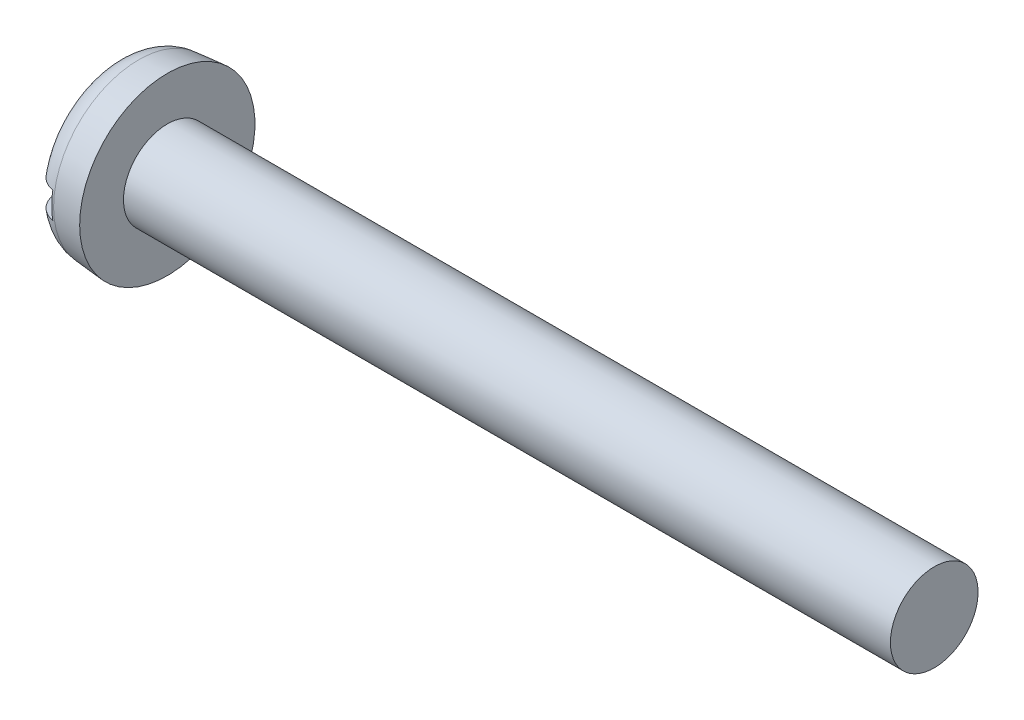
ISO-10303-21;
HEADER;
FILE_DESCRIPTION(('STEP AP214'),'2;1');
FILE_NAME('part.step','',(''),(''),'','','');
FILE_SCHEMA(('AUTOMOTIVE_DESIGN { 1 0 10303 214 1 1 1 1 }'));
ENDSEC;
DATA;
#1=APPLICATION_CONTEXT('core data for automotive mechanical design processes');
#2=APPLICATION_PROTOCOL_DEFINITION('international standard','automotive_design',2000,#1);
#3=PRODUCT_CONTEXT('',#1,'mechanical');
#4=PRODUCT('Part','Part','',(#3));
#5=PRODUCT_RELATED_PRODUCT_CATEGORY('part','',(#4));
#6=PRODUCT_DEFINITION_FORMATION('','',#4);
#7=PRODUCT_DEFINITION_CONTEXT('part definition',#1,'design');
#8=PRODUCT_DEFINITION('design','',#6,#7);
#9=PRODUCT_DEFINITION_SHAPE('','',#8);
#10=(LENGTH_UNIT() NAMED_UNIT(*) SI_UNIT(.MILLI.,.METRE.));
#11=(NAMED_UNIT(*) PLANE_ANGLE_UNIT() SI_UNIT($,.RADIAN.));
#12=(NAMED_UNIT(*) SI_UNIT($,.STERADIAN.) SOLID_ANGLE_UNIT());
#13=UNCERTAINTY_MEASURE_WITH_UNIT(LENGTH_MEASURE(1.E-05),#10,'distance_accuracy_value','');
#14=(GEOMETRIC_REPRESENTATION_CONTEXT(3) GLOBAL_UNCERTAINTY_ASSIGNED_CONTEXT((#13)) GLOBAL_UNIT_ASSIGNED_CONTEXT((#10,
#11,#12)) REPRESENTATION_CONTEXT('',''));
#15=CARTESIAN_POINT('',(0.,0.,0.));
#16=DIRECTION('',(0.,0.,1.));
#17=DIRECTION('',(1.,0.,0.));
#18=AXIS2_PLACEMENT_3D('',#15,#16,#17);
#19=CARTESIAN_POINT('',(0.,0.,0.));
#20=DIRECTION('',(-1.,0.,0.));
#21=DIRECTION('',(0.,0.,1.));
#22=AXIS2_PLACEMENT_3D('',#19,#20,#21);
#23=PLANE('',#22);
#24=DIRECTION('',(0.,0.,-1.));
#25=VECTOR('',#24,1.);
#26=CARTESIAN_POINT('',(0.,0.599999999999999,4.));
#27=LINE('',#26,#25);
#28=CARTESIAN_POINT('',(0.,0.599999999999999,2.62267277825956));
#29=VERTEX_POINT('',#28);
#30=CARTESIAN_POINT('',(0.,0.599999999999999,-2.62267277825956));
#31=VERTEX_POINT('',#30);
#32=EDGE_CURVE('E89',#29,#31,#27,.T.);
#33=ORIENTED_EDGE('',*,*,#32,.F.);
#34=CARTESIAN_POINT('',(0.,0.,0.));
#35=DIRECTION('',(-1.,0.,0.));
#36=DIRECTION('',(0.,0.,1.));
#37=AXIS2_PLACEMENT_3D('',#34,#35,#36);
#38=CIRCLE('',#37,2.69042979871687);
#39=EDGE_CURVE('E95',#29,#31,#38,.T.);
#40=ORIENTED_EDGE('',*,*,#39,.T.);
#41=EDGE_LOOP('',(#33,#40));
#42=FACE_BOUND('',#41,.T.);
#43=ADVANCED_FACE('F36',(#42),#23,.T.);
#44=CARTESIAN_POINT('',(-25.4,0.,0.));
#45=DIRECTION('',(-1.,0.,0.));
#46=DIRECTION('',(0.,0.,1.));
#47=AXIS2_PLACEMENT_3D('',#44,#45,#46);
#48=CYLINDRICAL_SURFACE('',#47,2.);
#49=CARTESIAN_POINT('',(37.4,0.,0.));
#50=DIRECTION('',(-1.,0.,0.));
#51=DIRECTION('',(0.,0.,1.));
#52=AXIS2_PLACEMENT_3D('',#49,#50,#51);
#53=CIRCLE('',#52,2.);
#54=CARTESIAN_POINT('',(37.4,0.,2.));
#55=VERTEX_POINT('',#54);
#56=EDGE_CURVE('E96',#55,#55,#53,.T.);
#57=ORIENTED_EDGE('',*,*,#56,.T.);
#58=EDGE_LOOP('',(#57));
#59=FACE_BOUND('',#58,.T.);
#60=CARTESIAN_POINT('',(2.4,0.,0.));
#61=DIRECTION('',(-1.,0.,0.));
#62=DIRECTION('',(0.,0.,1.));
#63=AXIS2_PLACEMENT_3D('',#60,#61,#62);
#64=CIRCLE('',#63,2.);
#65=CARTESIAN_POINT('',(2.4,0.,2.));
#66=VERTEX_POINT('',#65);
#67=EDGE_CURVE('E153',#66,#66,#64,.T.);
#68=ORIENTED_EDGE('',*,*,#67,.F.);
#69=EDGE_LOOP('',(#68));
#70=FACE_BOUND('',#69,.T.);
#71=ADVANCED_FACE('F141',(#59,#70),#48,.T.);
#72=CARTESIAN_POINT('',(37.4,2.,0.));
#73=DIRECTION('',(1.,0.,0.));
#74=DIRECTION('',(0.,0.,-1.));
#75=AXIS2_PLACEMENT_3D('',#72,#73,#74);
#76=PLANE('',#75);
#77=ORIENTED_EDGE('',*,*,#56,.F.);
#78=EDGE_LOOP('',(#77));
#79=FACE_BOUND('',#78,.T.);
#80=ADVANCED_FACE('F139',(#79),#76,.T.);
#81=DIRECTION('',(0.,0.,1.));
#82=VECTOR('',#81,1.);
#83=CARTESIAN_POINT('',(0.,-0.599999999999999,-4.));
#84=LINE('',#83,#82);
#85=CARTESIAN_POINT('',(0.,-0.6,-2.62267277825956));
#86=VERTEX_POINT('',#85);
#87=CARTESIAN_POINT('',(0.,-0.6,2.62267277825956));
#88=VERTEX_POINT('',#87);
#89=EDGE_CURVE('E80',#86,#88,#84,.T.);
#90=ORIENTED_EDGE('',*,*,#89,.F.);
#91=EDGE_CURVE('E87',#86,#88,#38,.T.);
#92=ORIENTED_EDGE('',*,*,#91,.T.);
#93=EDGE_LOOP('',(#90,#92));
#94=FACE_BOUND('',#93,.T.);
#95=ADVANCED_FACE('F86',(#94),#23,.T.);
#96=CARTESIAN_POINT('',(0.,0.,0.));
#97=DIRECTION('',(1.,0.,0.));
#98=DIRECTION('',(0.,0.,-1.));
#99=AXIS2_PLACEMENT_3D('',#96,#97,#98);
#100=CONICAL_SURFACE('',#99,3.79002720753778,0.0872664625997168);
#101=CARTESIAN_POINT('',(1.09541310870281,0.,0.));
#102=DIRECTION('',(-1.,0.,0.));
#103=DIRECTION('',(0.,0.,1.));
#104=AXIS2_PLACEMENT_3D('',#101,#102,#103);
#105=CIRCLE('',#104,3.88586343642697);
#106=CARTESIAN_POINT('',(1.09541310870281,0.,3.88586343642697));
#107=VERTEX_POINT('',#106);
#108=EDGE_CURVE('E99',#107,#107,#105,.F.);
#109=ORIENTED_EDGE('',*,*,#108,.T.);
#110=EDGE_LOOP('',(#109));
#111=FACE_BOUND('',#110,.T.);
#112=CARTESIAN_POINT('',(2.4,0.,0.));
#113=DIRECTION('',(-1.,0.,0.));
#114=DIRECTION('',(0.,0.,1.));
#115=AXIS2_PLACEMENT_3D('',#112,#113,#114);
#116=CIRCLE('',#115,4.);
#117=CARTESIAN_POINT('',(2.4,0.,4.));
#118=VERTEX_POINT('',#117);
#119=EDGE_CURVE('E101',#118,#118,#116,.T.);
#120=ORIENTED_EDGE('',*,*,#119,.T.);
#121=EDGE_LOOP('',(#120));
#122=FACE_BOUND('',#121,.T.);
#123=ADVANCED_FACE('F132',(#111,#122),#100,.T.);
#124=CARTESIAN_POINT('',(2.4,2.,0.));
#125=DIRECTION('',(-1.,0.,0.));
#126=DIRECTION('',(0.,0.,1.));
#127=AXIS2_PLACEMENT_3D('',#124,#125,#126);
#128=PLANE('',#127);
#129=ORIENTED_EDGE('',*,*,#119,.F.);
#130=EDGE_LOOP('',(#129));
#131=FACE_BOUND('',#130,.T.);
#132=ORIENTED_EDGE('',*,*,#67,.T.);
#133=EDGE_LOOP('',(#132));
#134=FACE_BOUND('',#133,.T.);
#135=ADVANCED_FACE('F128',(#131,#134),#128,.F.);
#136=CARTESIAN_POINT('',(1.2,0.,0.));
#137=DIRECTION('',(-1.,0.,0.));
#138=DIRECTION('',(0.,0.,1.));
#139=AXIS2_PLACEMENT_3D('',#136,#137,#138);
#140=TOROIDAL_SURFACE('',#139,2.69042979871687,1.2);
#141=CARTESIAN_POINT('',(0.3865043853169,0.599999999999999,-3.52185650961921));
#142=CARTESIAN_POINT('',(0.435468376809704,0.599999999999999,-3.56765543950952));
#143=CARTESIAN_POINT('',(0.48830443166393,0.599999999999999,-3.60938194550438));
#144=CARTESIAN_POINT('',(0.600265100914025,0.599999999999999,-3.68342203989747));
#145=CARTESIAN_POINT('',(0.659396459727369,0.599999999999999,-3.71572539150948));
#146=CARTESIAN_POINT('',(0.782252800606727,0.599999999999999,-3.76991557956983));
#147=CARTESIAN_POINT('',(0.845977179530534,0.599999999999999,-3.79180378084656));
#148=CARTESIAN_POINT('',(0.976191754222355,0.599999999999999,-3.82450279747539));
#149=CARTESIAN_POINT('',(1.04268130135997,0.599999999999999,-3.83531619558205));
#150=CARTESIAN_POINT('',(1.1761990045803,0.599999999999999,-3.84552483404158));
#151=CARTESIAN_POINT('',(1.2432228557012,0.599999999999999,-3.84497642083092));
#152=CARTESIAN_POINT('',(1.37622462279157,0.599999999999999,-3.83261582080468));
#153=CARTESIAN_POINT('',(1.44220252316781,0.599999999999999,-3.82080346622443));
#154=CARTESIAN_POINT('',(1.57113854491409,0.599999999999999,-3.7862937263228));
#155=CARTESIAN_POINT('',(1.63410108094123,0.599999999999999,-3.76361282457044));
#156=CARTESIAN_POINT('',(1.75534617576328,0.599999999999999,-3.70804459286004));
#157=CARTESIAN_POINT('',(1.81362870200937,0.599999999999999,-3.67515719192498));
#158=CARTESIAN_POINT('',(1.92413366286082,0.599999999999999,-3.5999836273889));
#159=CARTESIAN_POINT('',(1.97632984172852,0.599999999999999,-3.55765888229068));
#160=CARTESIAN_POINT('',(2.07296076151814,0.599999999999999,-3.46492588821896));
#161=CARTESIAN_POINT('',(2.11739523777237,0.599999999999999,-3.4145173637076));
#162=CARTESIAN_POINT('',(2.19773705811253,0.599999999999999,-3.30652404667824));
#163=CARTESIAN_POINT('',(2.2335546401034,0.599999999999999,-3.24887250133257));
#164=CARTESIAN_POINT('',(2.29517588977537,0.599999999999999,-3.12844912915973));
#165=CARTESIAN_POINT('',(2.32097889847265,0.599999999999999,-3.06567696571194));
#166=CARTESIAN_POINT('',(2.36230436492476,0.599999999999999,-2.93572304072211));
#167=CARTESIAN_POINT('',(2.37765465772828,0.599999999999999,-2.86848656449));
#168=CARTESIAN_POINT('',(2.39710654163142,0.599999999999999,-2.73240889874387));
#169=CARTESIAN_POINT('',(2.40120699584,0.599999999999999,-2.66356754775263));
#170=CARTESIAN_POINT('',(2.39814758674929,0.599999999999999,-2.52464946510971));
#171=CARTESIAN_POINT('',(2.39074269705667,0.599999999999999,-2.45457815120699));
#172=CARTESIAN_POINT('',(2.36454808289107,0.599999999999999,-2.31659764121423));
#173=CARTESIAN_POINT('',(2.34575688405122,0.599999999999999,-2.24868872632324));
#174=CARTESIAN_POINT('',(2.29682890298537,0.599999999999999,-2.11531585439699));
#175=CARTESIAN_POINT('',(2.26644200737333,0.599999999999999,-2.04994358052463));
#176=CARTESIAN_POINT('',(2.19524076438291,0.599999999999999,-1.92513363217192));
#177=CARTESIAN_POINT('',(2.15442449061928,0.599999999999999,-1.86569705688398));
#178=CARTESIAN_POINT('',(2.06294283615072,0.599999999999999,-1.75389115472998));
#179=CARTESIAN_POINT('',(2.01217853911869,0.599999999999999,-1.70160258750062));
#180=CARTESIAN_POINT('',(1.90235992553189,0.599999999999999,-1.60657192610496));
#181=CARTESIAN_POINT('',(1.84330597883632,0.599999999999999,-1.56382940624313));
#182=CARTESIAN_POINT('',(1.72028944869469,0.599999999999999,-1.49071034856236));
#183=CARTESIAN_POINT('',(1.65652070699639,0.599999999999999,-1.46000898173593));
#184=CARTESIAN_POINT('',(1.52445964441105,0.599999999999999,-1.41076217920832));
#185=CARTESIAN_POINT('',(1.45617085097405,0.599999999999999,-1.39220738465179));
#186=CARTESIAN_POINT('',(1.32258878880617,0.599999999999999,-1.3692588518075));
#187=CARTESIAN_POINT('',(1.25746124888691,0.599999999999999,-1.36389765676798));
#188=CARTESIAN_POINT('',(1.12729576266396,0.599999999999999,-1.36480396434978));
#189=CARTESIAN_POINT('',(1.06225779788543,0.599999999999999,-1.37106853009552));
#190=CARTESIAN_POINT('',(0.937361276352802,0.599999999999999,-1.39427975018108));
#191=CARTESIAN_POINT('',(0.877403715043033,0.599999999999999,-1.41070181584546));
#192=CARTESIAN_POINT('',(0.760914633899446,0.599999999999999,-1.45296891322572));
#193=CARTESIAN_POINT('',(0.704383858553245,0.599999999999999,-1.47881598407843));
#194=CARTESIAN_POINT('',(0.59370506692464,0.599999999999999,-1.54020998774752));
#195=CARTESIAN_POINT('',(0.539760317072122,0.599999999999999,-1.57612236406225));
#196=CARTESIAN_POINT('',(0.438104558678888,0.599999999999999,-1.65588570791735));
#197=CARTESIAN_POINT('',(0.390395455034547,0.599999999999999,-1.69973909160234));
#198=CARTESIAN_POINT('',(0.298820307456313,0.599999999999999,-1.79776253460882));
#199=CARTESIAN_POINT('',(0.255521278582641,0.599999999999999,-1.85246315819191));
#200=CARTESIAN_POINT('',(0.178283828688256,0.599999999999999,-1.96812037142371));
#201=CARTESIAN_POINT('',(0.144347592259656,0.599999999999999,-2.02907841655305));
#202=CARTESIAN_POINT('',(0.0855336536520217,0.599999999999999,-2.15824220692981));
#203=CARTESIAN_POINT('',(0.0610804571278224,0.599999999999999,-2.22664188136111));
#204=CARTESIAN_POINT('',(0.0240295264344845,0.599999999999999,-2.36658228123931));
#205=CARTESIAN_POINT('',(0.0114315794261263,0.599999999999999,-2.43812295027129));
#206=CARTESIAN_POINT('',(-0.00140349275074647,0.599999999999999,-2.58214276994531));
#207=CARTESIAN_POINT('',(-0.00166960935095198,0.599999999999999,-2.65461931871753));
#208=CARTESIAN_POINT('',(0.0102529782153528,0.599999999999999,-2.79856484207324));
#209=CARTESIAN_POINT('',(0.0224436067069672,0.599999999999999,-2.87003365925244));
#210=CARTESIAN_POINT('',(0.0586721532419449,0.599999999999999,-3.00828260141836));
#211=CARTESIAN_POINT('',(0.082454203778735,0.599999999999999,-3.07512990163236));
#212=CARTESIAN_POINT('',(0.141152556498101,0.599999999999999,-3.20367573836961));
#213=CARTESIAN_POINT('',(0.176053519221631,0.599999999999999,-3.26538122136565));
#214=CARTESIAN_POINT('',(0.240740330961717,0.599999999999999,-3.35956174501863));
#215=CARTESIAN_POINT('',(0.267410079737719,0.599999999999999,-3.39421743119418));
#216=CARTESIAN_POINT('',(0.324340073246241,0.599999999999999,-3.46044388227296));
#217=CARTESIAN_POINT('',(0.354600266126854,0.599999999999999,-3.49201469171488));
#218=CARTESIAN_POINT('',(0.3865043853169,0.599999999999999,-3.52185650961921));
#219=B_SPLINE_CURVE_WITH_KNOTS('',3,(#141,#142,#143,#144,#145,#146,#147,#148,#149,#150,#151,
#152,#153,#154,#155,#156,#157,#158,#159,#160,#161,#162,#163,#164,#165,#166,#167,#168,#169,#170,
#171,#172,#173,#174,#175,#176,#177,#178,#179,#180,#181,#182,#183,#184,#185,#186,#187,#188,#189,
#190,#191,#192,#193,#194,#195,#196,#197,#198,#199,#200,#201,#202,#203,#204,#205,#206,#207,#208,
#209,#210,#211,#212,#213,#214,#215,#216,#217,#218),.UNSPECIFIED.,.T.,.F.,(4,2,2,2,2,2,2,2,2,2,2,
2,2,2,2,2,2,2,2,2,2,2,2,2,2,2,2,2,2,2,2,2,2,2,2,2,2,2,4),(0.,0.200976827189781,
0.402171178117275,0.603339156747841,0.804460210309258,1.0045840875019,1.2047109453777,
1.40453524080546,1.60436092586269,1.80501901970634,2.00568395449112,2.2083565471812,
2.41104247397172,2.61699090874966,2.82296015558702,3.03337636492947,3.24381982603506,
3.45908552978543,3.67439102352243,3.8919572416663,4.10951375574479,4.32071351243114,
4.53175034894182,4.72677835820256,4.92175710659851,5.10742155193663,5.29312619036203,
5.48672044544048,5.68037370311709,5.88873369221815,6.09714225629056,6.31402614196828,
6.53090613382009,6.74727622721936,6.96367975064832,7.17550906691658,7.38704740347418,
7.51800243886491,7.64895558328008),.UNSPECIFIED.);
#220=CARTESIAN_POINT('',(1.,0.599999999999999,-3.8268957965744));
#221=VERTEX_POINT('',#220);
#222=EDGE_CURVE('E11',#31,#221,#219,.T.);
#223=ORIENTED_EDGE('',*,*,#222,.F.);
#224=ORIENTED_EDGE('',*,*,#39,.F.);
#225=CARTESIAN_POINT('',(0.568676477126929,0.599999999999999,1.55841219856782));
#226=CARTESIAN_POINT('',(0.622454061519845,0.599999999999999,1.52276443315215));
#227=CARTESIAN_POINT('',(0.679085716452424,0.599999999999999,1.49137245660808));
#228=CARTESIAN_POINT('',(0.796770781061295,0.599999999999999,1.43831139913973));
#229=CARTESIAN_POINT('',(0.857825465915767,0.599999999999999,1.41664513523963));
#230=CARTESIAN_POINT('',(0.982921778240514,0.599999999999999,1.38402811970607));
#231=CARTESIAN_POINT('',(1.04697051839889,0.599999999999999,1.37310440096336));
#232=CARTESIAN_POINT('',(1.17597937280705,0.599999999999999,1.36268675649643));
#233=CARTESIAN_POINT('',(1.24093916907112,0.599999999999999,1.36318893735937));
#234=CARTESIAN_POINT('',(1.36722529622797,0.599999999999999,1.37533615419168));
#235=CARTESIAN_POINT('',(1.42859438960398,0.599999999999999,1.38654477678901));
#236=CARTESIAN_POINT('',(1.54865022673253,0.599999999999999,1.41889802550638));
#237=CARTESIAN_POINT('',(1.60733638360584,0.599999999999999,1.44004481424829));
#238=CARTESIAN_POINT('',(1.72180457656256,0.599999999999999,1.49189888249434));
#239=CARTESIAN_POINT('',(1.77749881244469,0.599999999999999,1.52279911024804));
#240=CARTESIAN_POINT('',(1.88340638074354,0.599999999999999,1.59287167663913));
#241=CARTESIAN_POINT('',(1.93361816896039,0.599999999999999,1.63204633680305));
#242=CARTESIAN_POINT('',(2.03113053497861,0.599999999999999,1.7207614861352));
#243=CARTESIAN_POINT('',(2.07792119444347,0.599999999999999,1.77086293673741));
#244=CARTESIAN_POINT('',(2.16295007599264,0.599999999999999,1.87786529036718));
#245=CARTESIAN_POINT('',(2.20118595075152,0.599999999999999,1.93476805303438));
#246=CARTESIAN_POINT('',(2.26997158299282,0.599999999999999,2.05705672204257));
#247=CARTESIAN_POINT('',(2.30000838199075,0.599999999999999,2.12273201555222));
#248=CARTESIAN_POINT('',(2.34872218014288,0.599999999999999,2.25817360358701));
#249=CARTESIAN_POINT('',(2.36739836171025,0.599999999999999,2.32794019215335));
#250=CARTESIAN_POINT('',(2.39284815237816,0.599999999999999,2.47012141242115));
#251=CARTESIAN_POINT('',(2.3995382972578,0.599999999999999,2.54255105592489));
#252=CARTESIAN_POINT('',(2.40041533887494,0.599999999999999,2.68749005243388));
#253=CARTESIAN_POINT('',(2.39460324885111,0.599999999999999,2.75999939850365));
#254=CARTESIAN_POINT('',(2.37072428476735,0.599999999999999,2.90156578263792));
#255=CARTESIAN_POINT('',(2.35289092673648,0.599999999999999,2.97066215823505));
#256=CARTESIAN_POINT('',(2.3055955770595,0.599999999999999,3.10475609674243));
#257=CARTESIAN_POINT('',(2.2761350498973,0.599999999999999,3.16975417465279));
#258=CARTESIAN_POINT('',(2.20718370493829,0.599999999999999,3.29217559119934));
#259=CARTESIAN_POINT('',(2.16794580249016,0.599999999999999,3.34974141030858));
#260=CARTESIAN_POINT('',(2.08018656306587,0.599999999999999,3.45730019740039));
#261=CARTESIAN_POINT('',(2.03166624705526,0.599999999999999,3.50729399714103));
#262=CARTESIAN_POINT('',(1.92773605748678,0.599999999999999,3.59728886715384));
#263=CARTESIAN_POINT('',(1.87247613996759,0.599999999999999,3.63746317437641));
#264=CARTESIAN_POINT('',(1.75592540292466,0.599999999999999,3.70782235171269));
#265=CARTESIAN_POINT('',(1.69463504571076,0.599999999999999,3.73800798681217));
#266=CARTESIAN_POINT('',(1.5686108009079,0.599999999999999,3.78714975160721));
#267=CARTESIAN_POINT('',(1.50393088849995,0.599999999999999,3.80624437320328));
#268=CARTESIAN_POINT('',(1.37227430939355,0.599999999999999,3.83322369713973));
#269=CARTESIAN_POINT('',(1.30529774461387,0.599999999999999,3.84110889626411));
#270=CARTESIAN_POINT('',(1.17141837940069,0.599999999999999,3.845417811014));
#271=CARTESIAN_POINT('',(1.10451797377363,0.599999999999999,3.841916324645));
#272=CARTESIAN_POINT('',(0.972258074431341,0.599999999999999,3.82372114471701));
#273=CARTESIAN_POINT('',(0.906898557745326,0.599999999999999,3.80902761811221));
#274=CARTESIAN_POINT('',(0.779620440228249,0.599999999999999,3.76890152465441));
#275=CARTESIAN_POINT('',(0.717699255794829,0.599999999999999,3.74347714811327));
#276=CARTESIAN_POINT('',(0.598976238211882,0.599999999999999,3.68264222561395));
#277=CARTESIAN_POINT('',(0.542174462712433,0.599999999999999,3.64723156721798));
#278=CARTESIAN_POINT('',(0.434989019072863,0.599999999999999,3.56726339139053));
#279=CARTESIAN_POINT('',(0.384638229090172,0.599999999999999,3.5226618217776));
#280=CARTESIAN_POINT('',(0.292043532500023,0.599999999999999,3.42571932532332));
#281=CARTESIAN_POINT('',(0.249799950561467,0.599999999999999,3.37337808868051));
#282=CARTESIAN_POINT('',(0.174110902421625,0.599999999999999,3.26185326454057));
#283=CARTESIAN_POINT('',(0.140765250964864,0.599999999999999,3.20260196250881));
#284=CARTESIAN_POINT('',(0.0843091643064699,0.599999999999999,3.07941230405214));
#285=CARTESIAN_POINT('',(0.0611994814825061,0.599999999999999,3.01547360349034));
#286=CARTESIAN_POINT('',(0.0254327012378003,0.599999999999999,2.88357716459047));
#287=CARTESIAN_POINT('',(0.0129588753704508,0.599999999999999,2.81556976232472));
#288=CARTESIAN_POINT('',(-0.000658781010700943,0.599999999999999,2.67843562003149));
#289=CARTESIAN_POINT('',(-0.00180186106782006,0.599999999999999,2.60930880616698));
#290=CARTESIAN_POINT('',(0.00723867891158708,0.599999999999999,2.47027110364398));
#291=CARTESIAN_POINT('',(0.0176724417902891,0.599999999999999,2.40037650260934));
#292=CARTESIAN_POINT('',(0.0498636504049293,0.599999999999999,2.2632278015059));
#293=CARTESIAN_POINT('',(0.0716251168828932,0.599999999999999,2.19597464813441));
#294=CARTESIAN_POINT('',(0.126425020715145,0.599999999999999,2.06442921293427));
#295=CARTESIAN_POINT('',(0.159709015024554,0.599999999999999,2.00023925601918));
#296=CARTESIAN_POINT('',(0.236484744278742,0.599999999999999,1.87833288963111));
#297=CARTESIAN_POINT('',(0.279968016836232,0.599999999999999,1.82061117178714));
#298=CARTESIAN_POINT('',(0.363480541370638,0.599999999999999,1.7273106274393));
#299=CARTESIAN_POINT('',(0.401461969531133,0.599999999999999,1.68987927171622));
#300=CARTESIAN_POINT('',(0.481873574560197,0.599999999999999,1.62013708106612));
#301=CARTESIAN_POINT('',(0.524303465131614,0.599999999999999,1.58782591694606));
#302=CARTESIAN_POINT('',(0.568676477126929,0.599999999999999,1.55841219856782));
#303=B_SPLINE_CURVE_WITH_KNOTS('',3,(#225,#226,#227,#228,#229,#230,#231,#232,#233,#234,#235,
#236,#237,#238,#239,#240,#241,#242,#243,#244,#245,#246,#247,#248,#249,#250,#251,#252,#253,#254,
#255,#256,#257,#258,#259,#260,#261,#262,#263,#264,#265,#266,#267,#268,#269,#270,#271,#272,#273,
#274,#275,#276,#277,#278,#279,#280,#281,#282,#283,#284,#285,#286,#287,#288,#289,#290,#291,#292,
#293,#294,#295,#296,#297,#298,#299,#300,#301,#302),.UNSPECIFIED.,.T.,.F.,(4,2,2,2,2,2,2,2,2,2,2,
2,2,2,2,2,2,2,2,2,2,2,2,2,2,2,2,2,2,2,2,2,2,2,2,2,2,2,4),(0.,0.193385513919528,
0.386827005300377,0.580754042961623,0.774615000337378,0.960896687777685,1.14721893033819,
1.33748625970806,1.52780704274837,1.73256769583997,1.93738446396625,2.15302491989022,
2.3686808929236,2.58583282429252,2.80296715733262,3.01600070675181,3.22900743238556,
3.43699107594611,3.64495185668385,3.84892478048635,4.05288207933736,4.25423457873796,
4.45557815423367,4.65560180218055,4.85562246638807,5.05549074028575,5.25536126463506,
5.45621303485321,5.6570728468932,5.86009921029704,6.06314049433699,6.26961358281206,
6.47610034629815,6.68713711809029,6.89824884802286,7.11416888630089,7.3299104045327,
7.4894871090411,7.64905354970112),.UNSPECIFIED.);
#304=CARTESIAN_POINT('',(1.,0.599999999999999,3.8268957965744));
#305=VERTEX_POINT('',#304);
#306=EDGE_CURVE('E113',#305,#29,#303,.T.);
#307=ORIENTED_EDGE('',*,*,#306,.F.);
#308=CARTESIAN_POINT('',(1.,0.,0.));
#309=DIRECTION('',(-1.,0.,0.));
#310=DIRECTION('',(0.,0.,1.));
#311=AXIS2_PLACEMENT_3D('',#308,#309,#310);
#312=CIRCLE('',#311,3.8736457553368);
#313=CARTESIAN_POINT('',(1.,-0.600000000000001,3.8268957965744));
#314=VERTEX_POINT('',#313);
#315=EDGE_CURVE('E107',#305,#314,#312,.F.);
#316=ORIENTED_EDGE('',*,*,#315,.T.);
#317=CARTESIAN_POINT('',(0.568676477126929,-0.6,1.55841219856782));
#318=CARTESIAN_POINT('',(0.509332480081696,-0.6,1.59775463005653));
#319=CARTESIAN_POINT('',(0.453379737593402,-0.6,1.64234041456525));
#320=CARTESIAN_POINT('',(0.349719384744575,-0.6,1.74035526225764));
#321=CARTESIAN_POINT('',(0.302029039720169,-0.6,1.79380239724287));
#322=CARTESIAN_POINT('',(0.216237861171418,-0.6,1.90774469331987));
#323=CARTESIAN_POINT('',(0.178118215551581,-0.6,1.96822568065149));
#324=CARTESIAN_POINT('',(0.112363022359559,-0.6,2.0946004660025));
#325=CARTESIAN_POINT('',(0.0847225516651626,-0.6,2.16049170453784));
#326=CARTESIAN_POINT('',(0.0402688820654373,-0.6,2.29725613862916));
#327=CARTESIAN_POINT('',(0.0236758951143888,-0.6,2.36820113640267));
#328=CARTESIAN_POINT('',(0.00278349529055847,-0.6,2.51189141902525));
#329=CARTESIAN_POINT('',(-0.00151505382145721,-0.6,2.58463683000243));
#330=CARTESIAN_POINT('',(0.00243750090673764,-0.6,2.72894600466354));
#331=CARTESIAN_POINT('',(0.010543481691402,-0.6,2.80051368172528));
#332=CARTESIAN_POINT('',(0.0389520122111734,-0.6,2.94118836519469));
#333=CARTESIAN_POINT('',(0.0592529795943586,-0.6,3.01029568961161));
#334=CARTESIAN_POINT('',(0.110960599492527,-0.6,3.1423581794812));
#335=CARTESIAN_POINT('',(0.142096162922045,-0.6,3.20541948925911));
#336=CARTESIAN_POINT('',(0.214736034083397,-0.6,3.32525905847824));
#337=CARTESIAN_POINT('',(0.256239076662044,-0.6,3.38203808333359));
#338=CARTESIAN_POINT('',(0.347460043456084,-0.6,3.48641848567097));
#339=CARTESIAN_POINT('',(0.396982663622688,-0.6,3.53419059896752));
#340=CARTESIAN_POINT('',(0.503454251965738,-0.6,3.62058393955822));
#341=CARTESIAN_POINT('',(0.560402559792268,-0.600000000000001,3.6592059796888));
#342=CARTESIAN_POINT('',(0.67915616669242,-0.600000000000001,3.72559524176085));
#343=CARTESIAN_POINT('',(0.740873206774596,-0.600000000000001,3.75352040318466));
#344=CARTESIAN_POINT('',(0.868147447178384,-0.600000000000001,3.79850563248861));
#345=CARTESIAN_POINT('',(0.933704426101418,-0.600000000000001,3.81556632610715));
#346=CARTESIAN_POINT('',(1.06616217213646,-0.600000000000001,3.83820251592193));
#347=CARTESIAN_POINT('',(1.13304550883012,-0.600000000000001,3.84388011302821));
#348=CARTESIAN_POINT('',(1.26681198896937,-0.600000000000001,3.84388783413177));
#349=CARTESIAN_POINT('',(1.33369513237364,-0.600000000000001,3.83821825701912));
#350=CARTESIAN_POINT('',(1.46534857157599,-0.600000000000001,3.81573676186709));
#351=CARTESIAN_POINT('',(1.5301247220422,-0.600000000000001,3.79895909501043));
#352=CARTESIAN_POINT('',(1.65595122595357,-0.600000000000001,3.75479405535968));
#353=CARTESIAN_POINT('',(1.7170015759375,-0.600000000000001,3.72740667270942));
#354=CARTESIAN_POINT('',(1.83382644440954,-0.600000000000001,3.66274505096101));
#355=CARTESIAN_POINT('',(1.88958679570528,-0.6,3.62544522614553));
#356=CARTESIAN_POINT('',(1.99411858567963,-0.6,3.54208564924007));
#357=CARTESIAN_POINT('',(2.04288982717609,-0.6,3.49602565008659));
#358=CARTESIAN_POINT('',(2.1325144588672,-0.6,3.39605796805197));
#359=CARTESIAN_POINT('',(2.17329813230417,-0.6,3.34208780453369));
#360=CARTESIAN_POINT('',(2.245373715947,-0.6,3.22814724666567));
#361=CARTESIAN_POINT('',(2.27666509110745,-0.6,3.16817651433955));
#362=CARTESIAN_POINT('',(2.32937247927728,-0.6,3.04302336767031));
#363=CARTESIAN_POINT('',(2.35063955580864,-0.6,2.97777826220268));
#364=CARTESIAN_POINT('',(2.3821555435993,-0.6,2.84468257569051));
#365=CARTESIAN_POINT('',(2.39240345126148,-0.6,2.77683175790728));
#366=CARTESIAN_POINT('',(2.40182781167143,-0.6,2.6389851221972));
#367=CARTESIAN_POINT('',(2.40077563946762,-0.6,2.56897370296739));
#368=CARTESIAN_POINT('',(2.38721389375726,-0.6,2.43007140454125));
#369=CARTESIAN_POINT('',(2.37470291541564,-0.6,2.36118066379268));
#370=CARTESIAN_POINT('',(2.33824897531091,-0.6,2.22476443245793));
#371=CARTESIAN_POINT('',(2.31404566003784,-0.6,2.15730848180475));
#372=CARTESIAN_POINT('',(2.25484108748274,-0.6,2.02730649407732));
#373=CARTESIAN_POINT('',(2.21983804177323,-0.6,1.96476127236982));
#374=CARTESIAN_POINT('',(2.13932874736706,-0.6,1.8453529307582));
#375=CARTESIAN_POINT('',(2.09366234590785,-0.6,1.78859760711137));
#376=CARTESIAN_POINT('',(1.99331431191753,-0.6,1.68367587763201));
#377=CARTESIAN_POINT('',(1.93863170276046,-0.6,1.63551040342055));
#378=CARTESIAN_POINT('',(1.82254625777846,-0.6,1.55016942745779));
#379=CARTESIAN_POINT('',(1.7612597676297,-0.6,1.51283623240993));
#380=CARTESIAN_POINT('',(1.6329601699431,-0.6,1.44984263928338));
#381=CARTESIAN_POINT('',(1.56595104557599,-0.6,1.42417419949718));
#382=CARTESIAN_POINT('',(1.43290073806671,-0.6,1.38720166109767));
#383=CARTESIAN_POINT('',(1.36709528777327,-0.6,1.37505067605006));
#384=CARTESIAN_POINT('',(1.23436273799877,-0.6,1.3628486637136));
#385=CARTESIAN_POINT('',(1.16743586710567,-0.6,1.36279519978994));
#386=CARTESIAN_POINT('',(1.03904581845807,-0.6,1.37438428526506));
#387=CARTESIAN_POINT('',(0.97751125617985,-0.6,1.38526326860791));
#388=CARTESIAN_POINT('',(0.857136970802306,-0.6,1.41700902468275));
#389=CARTESIAN_POINT('',(0.79829431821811,-0.6,1.43786464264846));
#390=CARTESIAN_POINT('',(0.711456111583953,-0.6,1.47666141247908));
#391=CARTESIAN_POINT('',(0.681965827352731,-0.6,1.49136190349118));
#392=CARTESIAN_POINT('',(0.624300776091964,-0.6,1.52313858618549));
#393=CARTESIAN_POINT('',(0.596125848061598,-0.6,1.54021448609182));
#394=CARTESIAN_POINT('',(0.568676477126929,-0.6,1.55841219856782));
#395=B_SPLINE_CURVE_WITH_KNOTS('',3,(#317,#318,#319,#320,#321,#322,#323,#324,#325,#326,#327,
#328,#329,#330,#331,#332,#333,#334,#335,#336,#337,#338,#339,#340,#341,#342,#343,#344,#345,#346,
#347,#348,#349,#350,#351,#352,#353,#354,#355,#356,#357,#358,#359,#360,#361,#362,#363,#364,#365,
#366,#367,#368,#369,#370,#371,#372,#373,#374,#375,#376,#377,#378,#379,#380,#381,#382,#383,#384,
#385,#386,#387,#388,#389,#390,#391,#392,#393,#394),.UNSPECIFIED.,.T.,.F.,(4,2,2,2,2,2,2,2,2,2,2,
2,2,2,2,2,2,2,2,2,2,2,2,2,2,2,2,2,2,2,2,2,2,2,2,2,2,2,4),(0.,0.2134759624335,0.427392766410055,
0.640885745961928,0.854278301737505,1.07180637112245,1.28934972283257,1.50436737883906,
1.71935714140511,1.92931435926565,2.13924596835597,2.34467456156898,2.55008489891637,
2.75233330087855,2.95457005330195,3.15498457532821,3.355393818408,3.55518797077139,
3.75498230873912,3.95529744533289,4.15561823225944,4.35761633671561,4.55962582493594,
4.76454879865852,4.96949043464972,5.17858616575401,5.38770753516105,5.60171647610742,
5.815760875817,6.03325422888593,6.25077115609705,6.46494128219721,6.67896353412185,
6.87865214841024,7.07830054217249,7.26491113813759,7.4513135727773,7.55006829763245,
7.64881090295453),.UNSPECIFIED.);
#396=EDGE_CURVE('E94',#88,#314,#395,.T.);
#397=ORIENTED_EDGE('',*,*,#396,.F.);
#398=ORIENTED_EDGE('',*,*,#91,.F.);
#399=CARTESIAN_POINT('',(0.3865043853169,-0.6,-3.52185650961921));
#400=CARTESIAN_POINT('',(0.336558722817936,-0.6,-3.47513075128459));
#401=CARTESIAN_POINT('',(0.290567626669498,-0.6,-3.42409544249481));
#402=CARTESIAN_POINT('',(0.207816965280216,-0.6,-3.31495007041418));
#403=CARTESIAN_POINT('',(0.171070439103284,-0.6,-3.2568301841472));
#404=CARTESIAN_POINT('',(0.107859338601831,-0.6,-3.13533662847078));
#405=CARTESIAN_POINT('',(0.081381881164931,-0.6,-3.07196966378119));
#406=CARTESIAN_POINT('',(0.0392838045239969,-0.6,-2.94175448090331));
#407=CARTESIAN_POINT('',(0.0236604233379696,-0.6,-2.87490715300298));
#408=CARTESIAN_POINT('',(0.00341113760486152,-0.6,-2.73858284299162));
#409=CARTESIAN_POINT('',(-0.00105268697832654,-0.6,-2.66908182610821));
#410=CARTESIAN_POINT('',(0.00147102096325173,-0.6,-2.53028718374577));
#411=CARTESIAN_POINT('',(0.00846038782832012,-0.6,-2.46099359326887));
#412=CARTESIAN_POINT('',(0.0338721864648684,-0.6,-2.3228723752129));
#413=CARTESIAN_POINT('',(0.052556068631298,-0.6,-2.25409284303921));
#414=CARTESIAN_POINT('',(0.100979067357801,-0.6,-2.12053875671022));
#415=CARTESIAN_POINT('',(0.13071979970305,-0.6,-2.05576478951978));
#416=CARTESIAN_POINT('',(0.201105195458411,-0.6,-1.93075930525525));
#417=CARTESIAN_POINT('',(0.241951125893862,-0.6,-1.87064095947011));
#418=CARTESIAN_POINT('',(0.333200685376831,-0.6,-1.75812796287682));
#419=CARTESIAN_POINT('',(0.383605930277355,-0.6,-1.70573462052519));
#420=CARTESIAN_POINT('',(0.49243046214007,-0.6,-1.61063718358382));
#421=CARTESIAN_POINT('',(0.550808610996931,-0.6,-1.5678861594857));
#422=CARTESIAN_POINT('',(0.674249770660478,-0.6,-1.49345451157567));
#423=CARTESIAN_POINT('',(0.739309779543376,-0.6,-1.46176894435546));
#424=CARTESIAN_POINT('',(0.870462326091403,-0.6,-1.41247032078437));
#425=CARTESIAN_POINT('',(0.936297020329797,-0.6,-1.39417366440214));
#426=CARTESIAN_POINT('',(1.0701878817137,-0.6,-1.36992148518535));
#427=CARTESIAN_POINT('',(1.13824253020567,-0.6,-1.36395769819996));
#428=CARTESIAN_POINT('',(1.26912997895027,-0.6,-1.36469761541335));
#429=CARTESIAN_POINT('',(1.33196990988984,-0.6,-1.37048080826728));
#430=CARTESIAN_POINT('',(1.45576558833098,-0.6,-1.39257493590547));
#431=CARTESIAN_POINT('',(1.51672119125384,-0.6,-1.40888667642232));
#432=CARTESIAN_POINT('',(1.63489640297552,-0.6,-1.45115860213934));
#433=CARTESIAN_POINT('',(1.6921296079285,-0.6,-1.47708105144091));
#434=CARTESIAN_POINT('',(1.80183592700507,-0.6,-1.53754737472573));
#435=CARTESIAN_POINT('',(1.85430778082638,-0.6,-1.57209352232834));
#436=CARTESIAN_POINT('',(1.95690912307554,-0.6,-1.65139148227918));
#437=CARTESIAN_POINT('',(2.00661704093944,-0.6,-1.69668868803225));
#438=CARTESIAN_POINT('',(2.09829662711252,-0.6,-1.79453297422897));
#439=CARTESIAN_POINT('',(2.14026595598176,-0.6,-1.84708223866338));
#440=CARTESIAN_POINT('',(2.21793843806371,-0.6,-1.96160125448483));
#441=CARTESIAN_POINT('',(2.25307298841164,-0.6,-2.02395766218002));
#442=CARTESIAN_POINT('',(2.31259182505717,-0.6,-2.15361082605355));
#443=CARTESIAN_POINT('',(2.33697474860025,-0.6,-2.22090820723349));
#444=CARTESIAN_POINT('',(2.37457912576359,-0.6,-2.35984116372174));
#445=CARTESIAN_POINT('',(2.38759592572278,-0.6,-2.43153235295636));
#446=CARTESIAN_POINT('',(2.40121636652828,-0.6,-2.57608878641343));
#447=CARTESIAN_POINT('',(2.40182066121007,-0.6,-2.64895396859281));
#448=CARTESIAN_POINT('',(2.39052951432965,-0.6,-2.79263451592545));
#449=CARTESIAN_POINT('',(2.37881794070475,-0.6,-2.86346426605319));
#450=CARTESIAN_POINT('',(2.34337531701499,-0.6,-3.00205279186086));
#451=CARTESIAN_POINT('',(2.31964575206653,-0.6,-3.06981194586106));
#452=CARTESIAN_POINT('',(2.26145401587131,-0.6,-3.19862221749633));
#453=CARTESIAN_POINT('',(2.22725936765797,-0.6,-3.25979420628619));
#454=CARTESIAN_POINT('',(2.14887906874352,-0.6,-3.375364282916));
#455=CARTESIAN_POINT('',(2.10469456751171,-0.6,-3.42976314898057));
#456=CARTESIAN_POINT('',(2.00858874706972,-0.6,-3.52906182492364));
#457=CARTESIAN_POINT('',(1.95684621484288,-0.599999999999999,-3.57413473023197));
#458=CARTESIAN_POINT('',(1.84643427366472,-0.599999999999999,-3.65480066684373));
#459=CARTESIAN_POINT('',(1.78776544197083,-0.599999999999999,-3.6903944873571));
#460=CARTESIAN_POINT('',(1.66608419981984,-0.599999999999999,-3.75057174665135));
#461=CARTESIAN_POINT('',(1.60314657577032,-0.599999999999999,-3.77530647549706));
#462=CARTESIAN_POINT('',(1.47399447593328,-0.599999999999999,-3.81375981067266));
#463=CARTESIAN_POINT('',(1.40778030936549,-0.599999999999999,-3.82747945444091));
#464=CARTESIAN_POINT('',(1.27453622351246,-0.599999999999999,-3.84342379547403));
#465=CARTESIAN_POINT('',(1.20751747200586,-0.599999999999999,-3.8457419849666));
#466=CARTESIAN_POINT('',(1.07402733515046,-0.599999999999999,-3.83906549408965));
#467=CARTESIAN_POINT('',(1.00755608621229,-0.599999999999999,-3.83006807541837));
#468=CARTESIAN_POINT('',(0.877192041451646,-0.599999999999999,-3.80105552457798));
#469=CARTESIAN_POINT('',(0.813295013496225,-0.599999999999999,-3.78105934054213));
#470=CARTESIAN_POINT('',(0.68980965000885,-0.599999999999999,-3.73066689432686));
#471=CARTESIAN_POINT('',(0.630215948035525,-0.599999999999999,-3.7002838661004));
#472=CARTESIAN_POINT('',(0.540159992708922,-0.599999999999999,-3.64444320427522));
#473=CARTESIAN_POINT('',(0.507753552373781,-0.6,-3.62205529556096));
#474=CARTESIAN_POINT('',(0.445296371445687,-0.6,-3.57420610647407));
#475=CARTESIAN_POINT('',(0.415245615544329,-0.6,-3.54874484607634));
#476=CARTESIAN_POINT('',(0.3865043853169,-0.6,-3.52185650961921));
#477=B_SPLINE_CURVE_WITH_KNOTS('',3,(#399,#400,#401,#402,#403,#404,#405,#406,#407,#408,#409,
#410,#411,#412,#413,#414,#415,#416,#417,#418,#419,#420,#421,#422,#423,#424,#425,#426,#427,#428,
#429,#430,#431,#432,#433,#434,#435,#436,#437,#438,#439,#440,#441,#442,#443,#444,#445,#446,#447,
#448,#449,#450,#451,#452,#453,#454,#455,#456,#457,#458,#459,#460,#461,#462,#463,#464,#465,#466,
#467,#468,#469,#470,#471,#472,#473,#474,#475,#476),.UNSPECIFIED.,.T.,.F.,(4,2,2,2,2,2,2,2,2,2,2,
2,2,2,2,2,2,2,2,2,2,2,2,2,2,2,2,2,2,2,2,2,2,2,2,2,2,2,4),(0.,0.205037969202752,
0.410363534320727,0.615430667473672,0.82044559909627,1.02842128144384,1.23643027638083,
1.44926442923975,1.66212969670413,1.87914472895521,2.09619647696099,2.31216786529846,
2.52804264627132,2.73193279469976,2.93568627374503,3.12408907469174,3.31250629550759,
3.50019140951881,3.68792605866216,3.88881168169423,4.08975793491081,4.3034897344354,
4.51724861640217,4.73478137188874,4.95230266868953,5.16662200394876,5.38091486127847,
5.59013202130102,5.79932512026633,6.00419443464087,6.20904668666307,6.41094657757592,
6.61282745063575,6.81305010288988,7.01332121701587,7.2132483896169,7.41292177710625,
7.53091163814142,7.64890073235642),.UNSPECIFIED.);
#478=CARTESIAN_POINT('',(1.,-0.599999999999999,-3.8268957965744));
#479=VERTEX_POINT('',#478);
#480=EDGE_CURVE('E48',#479,#86,#477,.T.);
#481=ORIENTED_EDGE('',*,*,#480,.F.);
#482=EDGE_CURVE('E60',#479,#221,#312,.F.);
#483=ORIENTED_EDGE('',*,*,#482,.T.);
#484=EDGE_LOOP('',(#223,#224,#307,#316,#397,#398,#481,#483));
#485=FACE_BOUND('',#484,.T.);
#486=ORIENTED_EDGE('',*,*,#108,.F.);
#487=EDGE_LOOP('',(#486));
#488=FACE_BOUND('',#487,.T.);
#489=ADVANCED_FACE('F38',(#485,#488),#140,.T.);
#490=CARTESIAN_POINT('',(1.,0.599999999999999,4.));
#491=DIRECTION('',(0.,1.,0.));
#492=DIRECTION('',(0.,0.,1.));
#493=AXIS2_PLACEMENT_3D('',#490,#491,#492);
#494=PLANE('',#493);
#495=ORIENTED_EDGE('',*,*,#222,.T.);
#496=DIRECTION('',(0.,0.,-1.));
#497=VECTOR('',#496,1.);
#498=CARTESIAN_POINT('',(1.,0.599999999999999,4.));
#499=LINE('',#498,#497);
#500=EDGE_CURVE('E88',#305,#221,#499,.T.);
#501=ORIENTED_EDGE('',*,*,#500,.F.);
#502=ORIENTED_EDGE('',*,*,#306,.T.);
#503=ORIENTED_EDGE('',*,*,#32,.T.);
#504=EDGE_LOOP('',(#495,#501,#502,#503));
#505=FACE_BOUND('',#504,.T.);
#506=ADVANCED_FACE('F120',(#505),#494,.F.);
#507=CARTESIAN_POINT('',(1.,-0.599999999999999,-4.));
#508=DIRECTION('',(0.,-1.,0.));
#509=DIRECTION('',(0.,0.,-1.));
#510=AXIS2_PLACEMENT_3D('',#507,#508,#509);
#511=PLANE('',#510);
#512=ORIENTED_EDGE('',*,*,#480,.T.);
#513=ORIENTED_EDGE('',*,*,#89,.T.);
#514=ORIENTED_EDGE('',*,*,#396,.T.);
#515=DIRECTION('',(0.,0.,1.));
#516=VECTOR('',#515,1.);
#517=CARTESIAN_POINT('',(1.,-0.599999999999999,-4.));
#518=LINE('',#517,#516);
#519=EDGE_CURVE('E55',#479,#314,#518,.T.);
#520=ORIENTED_EDGE('',*,*,#519,.F.);
#521=EDGE_LOOP('',(#512,#513,#514,#520));
#522=FACE_BOUND('',#521,.T.);
#523=ADVANCED_FACE('F79',(#522),#511,.F.);
#524=CARTESIAN_POINT('',(1.,0.599999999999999,-4.));
#525=DIRECTION('',(-1.,0.,0.));
#526=DIRECTION('',(0.,0.,1.));
#527=AXIS2_PLACEMENT_3D('',#524,#525,#526);
#528=PLANE('',#527);
#529=ORIENTED_EDGE('',*,*,#519,.T.);
#530=ORIENTED_EDGE('',*,*,#315,.F.);
#531=ORIENTED_EDGE('',*,*,#500,.T.);
#532=ORIENTED_EDGE('',*,*,#482,.F.);
#533=EDGE_LOOP('',(#529,#530,#531,#532));
#534=FACE_BOUND('',#533,.T.);
#535=ADVANCED_FACE('F119',(#534),#528,.T.);
#536=CLOSED_SHELL('',(#43,#71,#80,#95,#123,#135,#489,#506,#523,#535));
#537=MANIFOLD_SOLID_BREP('B2',#536);
#538=ADVANCED_BREP_SHAPE_REPRESENTATION('',(#18,#537),#14);
#539=SHAPE_DEFINITION_REPRESENTATION(#9,#538);
ENDSEC;
END-ISO-10303-21;
